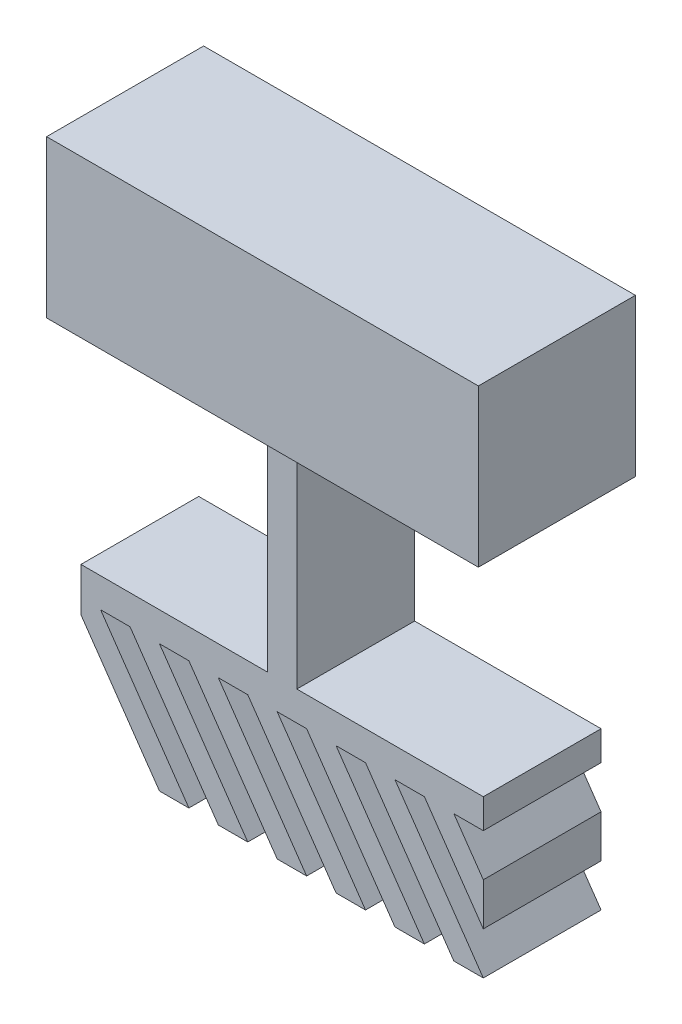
ISO-10303-21;
HEADER;
FILE_DESCRIPTION(('STEP AP214'),'2;1');
FILE_NAME('part.step','',(''),(''),'','','');
FILE_SCHEMA(('AUTOMOTIVE_DESIGN { 1 0 10303 214 1 1 1 1 }'));
ENDSEC;
DATA;
#1=APPLICATION_CONTEXT('core data for automotive mechanical design processes');
#2=APPLICATION_PROTOCOL_DEFINITION('international standard','automotive_design',2000,#1);
#3=PRODUCT_CONTEXT('',#1,'mechanical');
#4=PRODUCT('Part','Part','',(#3));
#5=PRODUCT_RELATED_PRODUCT_CATEGORY('part','',(#4));
#6=PRODUCT_DEFINITION_FORMATION('','',#4);
#7=PRODUCT_DEFINITION_CONTEXT('part definition',#1,'design');
#8=PRODUCT_DEFINITION('design','',#6,#7);
#9=PRODUCT_DEFINITION_SHAPE('','',#8);
#10=(LENGTH_UNIT() NAMED_UNIT(*) SI_UNIT(.MILLI.,.METRE.));
#11=(NAMED_UNIT(*) PLANE_ANGLE_UNIT() SI_UNIT($,.RADIAN.));
#12=(NAMED_UNIT(*) SI_UNIT($,.STERADIAN.) SOLID_ANGLE_UNIT());
#13=UNCERTAINTY_MEASURE_WITH_UNIT(LENGTH_MEASURE(1.E-05),#10,'distance_accuracy_value','');
#14=(GEOMETRIC_REPRESENTATION_CONTEXT(3) GLOBAL_UNCERTAINTY_ASSIGNED_CONTEXT((#13)) GLOBAL_UNIT_ASSIGNED_CONTEXT((#10,
#11,#12)) REPRESENTATION_CONTEXT('',''));
#15=CARTESIAN_POINT('',(0.,0.,0.));
#16=DIRECTION('',(0.,0.,1.));
#17=DIRECTION('',(1.,0.,0.));
#18=AXIS2_PLACEMENT_3D('',#15,#16,#17);
#19=CARTESIAN_POINT('',(-7.5,-150.,-30.));
#20=DIRECTION('',(-1.,0.,0.));
#21=DIRECTION('',(0.,-1.,0.));
#22=AXIS2_PLACEMENT_3D('',#19,#20,#21);
#23=PLANE('',#22);
#24=DIRECTION('',(0.,0.,1.));
#25=VECTOR('',#24,1.);
#26=CARTESIAN_POINT('',(-7.5,-150.,-30.));
#27=LINE('',#26,#25);
#28=CARTESIAN_POINT('',(-7.5,-150.,-30.));
#29=VERTEX_POINT('',#28);
#30=CARTESIAN_POINT('',(-7.5,-150.,30.));
#31=VERTEX_POINT('',#30);
#32=EDGE_CURVE('E44',#29,#31,#27,.T.);
#33=ORIENTED_EDGE('',*,*,#32,.T.);
#34=DIRECTION('',(0.,-1.,0.));
#35=VECTOR('',#34,1.);
#36=CARTESIAN_POINT('',(-7.5,-150.,30.));
#37=LINE('',#36,#35);
#38=CARTESIAN_POINT('',(-7.50000000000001,0.,30.));
#39=VERTEX_POINT('',#38);
#40=EDGE_CURVE('E267',#39,#31,#37,.T.);
#41=ORIENTED_EDGE('',*,*,#40,.F.);
#42=DIRECTION('',(0.,0.,1.));
#43=VECTOR('',#42,1.);
#44=CARTESIAN_POINT('',(-7.50000000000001,0.,-30.));
#45=LINE('',#44,#43);
#46=CARTESIAN_POINT('',(-7.50000000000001,0.,-30.));
#47=VERTEX_POINT('',#46);
#48=EDGE_CURVE('E12',#47,#39,#45,.T.);
#49=ORIENTED_EDGE('',*,*,#48,.F.);
#50=DIRECTION('',(0.,-1.,0.));
#51=VECTOR('',#50,1.);
#52=CARTESIAN_POINT('',(-7.5,-150.,-30.));
#53=LINE('',#52,#51);
#54=EDGE_CURVE('E268',#47,#29,#53,.T.);
#55=ORIENTED_EDGE('',*,*,#54,.T.);
#56=EDGE_LOOP('',(#33,#41,#49,#55));
#57=FACE_BOUND('',#56,.T.);
#58=ADVANCED_FACE('F41',(#57),#23,.T.);
#59=CARTESIAN_POINT('',(-7.50000000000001,0.,-30.));
#60=DIRECTION('',(0.,1.,0.));
#61=DIRECTION('',(0.,0.,1.));
#62=AXIS2_PLACEMENT_3D('',#59,#60,#61);
#63=PLANE('',#62);
#64=ORIENTED_EDGE('',*,*,#48,.T.);
#65=DIRECTION('',(-1.,0.,0.));
#66=VECTOR('',#65,1.);
#67=CARTESIAN_POINT('',(-7.50000000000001,0.,30.));
#68=LINE('',#67,#66);
#69=CARTESIAN_POINT('',(7.50000000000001,0.,30.));
#70=VERTEX_POINT('',#69);
#71=EDGE_CURVE('E285',#70,#39,#68,.T.);
#72=ORIENTED_EDGE('',*,*,#71,.F.);
#73=DIRECTION('',(0.,0.,1.));
#74=VECTOR('',#73,1.);
#75=CARTESIAN_POINT('',(7.50000000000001,0.,-30.));
#76=LINE('',#75,#74);
#77=CARTESIAN_POINT('',(7.50000000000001,0.,-30.));
#78=VERTEX_POINT('',#77);
#79=EDGE_CURVE('E49',#78,#70,#76,.T.);
#80=ORIENTED_EDGE('',*,*,#79,.F.);
#81=DIRECTION('',(-1.,0.,0.));
#82=VECTOR('',#81,1.);
#83=CARTESIAN_POINT('',(-7.50000000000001,0.,-30.));
#84=LINE('',#83,#82);
#85=EDGE_CURVE('E273',#78,#47,#84,.T.);
#86=ORIENTED_EDGE('',*,*,#85,.T.);
#87=EDGE_LOOP('',(#64,#72,#80,#86));
#88=FACE_BOUND('',#87,.T.);
#89=ADVANCED_FACE('F673',(#88),#63,.T.);
#90=CARTESIAN_POINT('',(7.50000000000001,0.,-30.));
#91=DIRECTION('',(1.,0.,0.));
#92=DIRECTION('',(0.,1.,0.));
#93=AXIS2_PLACEMENT_3D('',#90,#91,#92);
#94=PLANE('',#93);
#95=ORIENTED_EDGE('',*,*,#79,.T.);
#96=DIRECTION('',(0.,1.,0.));
#97=VECTOR('',#96,1.);
#98=CARTESIAN_POINT('',(7.50000000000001,0.,30.));
#99=LINE('',#98,#97);
#100=CARTESIAN_POINT('',(7.5,-150.,30.));
#101=VERTEX_POINT('',#100);
#102=EDGE_CURVE('E379',#101,#70,#99,.T.);
#103=ORIENTED_EDGE('',*,*,#102,.F.);
#104=DIRECTION('',(0.,0.,1.));
#105=VECTOR('',#104,1.);
#106=CARTESIAN_POINT('',(7.5,-150.,-30.));
#107=LINE('',#106,#105);
#108=CARTESIAN_POINT('',(7.5,-150.,-30.));
#109=VERTEX_POINT('',#108);
#110=EDGE_CURVE('E482',#109,#101,#107,.T.);
#111=ORIENTED_EDGE('',*,*,#110,.F.);
#112=DIRECTION('',(0.,1.,0.));
#113=VECTOR('',#112,1.);
#114=CARTESIAN_POINT('',(7.50000000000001,0.,-30.));
#115=LINE('',#114,#113);
#116=EDGE_CURVE('E478',#109,#78,#115,.T.);
#117=ORIENTED_EDGE('',*,*,#116,.T.);
#118=EDGE_LOOP('',(#95,#103,#111,#117));
#119=FACE_BOUND('',#118,.T.);
#120=ADVANCED_FACE('F672',(#119),#94,.T.);
#121=CARTESIAN_POINT('',(7.5,-150.,-30.));
#122=DIRECTION('',(0.,1.,0.));
#123=DIRECTION('',(-1.,0.,0.));
#124=AXIS2_PLACEMENT_3D('',#121,#122,#123);
#125=PLANE('',#124);
#126=ORIENTED_EDGE('',*,*,#110,.T.);
#127=DIRECTION('',(-1.,0.,0.));
#128=VECTOR('',#127,1.);
#129=CARTESIAN_POINT('',(7.5,-150.,30.));
#130=LINE('',#129,#128);
#131=CARTESIAN_POINT('',(102.5,-150.,30.));
#132=VERTEX_POINT('',#131);
#133=EDGE_CURVE('E376',#132,#101,#130,.T.);
#134=ORIENTED_EDGE('',*,*,#133,.F.);
#135=DIRECTION('',(0.,0.,1.));
#136=VECTOR('',#135,1.);
#137=CARTESIAN_POINT('',(102.5,-150.,-30.));
#138=LINE('',#137,#136);
#139=CARTESIAN_POINT('',(102.5,-150.,-30.));
#140=VERTEX_POINT('',#139);
#141=EDGE_CURVE('E484',#140,#132,#138,.T.);
#142=ORIENTED_EDGE('',*,*,#141,.F.);
#143=DIRECTION('',(-1.,0.,0.));
#144=VECTOR('',#143,1.);
#145=CARTESIAN_POINT('',(7.5,-150.,-30.));
#146=LINE('',#145,#144);
#147=EDGE_CURVE('E475',#140,#109,#146,.T.);
#148=ORIENTED_EDGE('',*,*,#147,.T.);
#149=EDGE_LOOP('',(#126,#134,#142,#148));
#150=FACE_BOUND('',#149,.T.);
#151=ADVANCED_FACE('F668',(#150),#125,.T.);
#152=CARTESIAN_POINT('',(102.5,-150.,-30.));
#153=DIRECTION('',(1.,0.,0.));
#154=DIRECTION('',(0.,1.,0.));
#155=AXIS2_PLACEMENT_3D('',#152,#153,#154);
#156=PLANE('',#155);
#157=ORIENTED_EDGE('',*,*,#141,.T.);
#158=DIRECTION('',(0.,1.,0.));
#159=VECTOR('',#158,1.);
#160=CARTESIAN_POINT('',(102.5,-150.,30.));
#161=LINE('',#160,#159);
#162=CARTESIAN_POINT('',(102.5,-165.,30.));
#163=VERTEX_POINT('',#162);
#164=EDGE_CURVE('E373',#163,#132,#161,.T.);
#165=ORIENTED_EDGE('',*,*,#164,.F.);
#166=DIRECTION('',(0.,0.,1.));
#167=VECTOR('',#166,1.);
#168=CARTESIAN_POINT('',(102.5,-165.,-30.));
#169=LINE('',#168,#167);
#170=CARTESIAN_POINT('',(102.5,-165.,-30.));
#171=VERTEX_POINT('',#170);
#172=EDGE_CURVE('E486',#171,#163,#169,.T.);
#173=ORIENTED_EDGE('',*,*,#172,.F.);
#174=DIRECTION('',(0.,1.,0.));
#175=VECTOR('',#174,1.);
#176=CARTESIAN_POINT('',(102.5,-150.,-30.));
#177=LINE('',#176,#175);
#178=EDGE_CURVE('E472',#171,#140,#177,.T.);
#179=ORIENTED_EDGE('',*,*,#178,.T.);
#180=EDGE_LOOP('',(#157,#165,#173,#179));
#181=FACE_BOUND('',#180,.T.);
#182=ADVANCED_FACE('F663',(#181),#156,.T.);
#183=CARTESIAN_POINT('',(102.5,-165.,-30.));
#184=DIRECTION('',(0.,-1.,0.));
#185=DIRECTION('',(0.,0.,-1.));
#186=AXIS2_PLACEMENT_3D('',#183,#184,#185);
#187=PLANE('',#186);
#188=ORIENTED_EDGE('',*,*,#172,.T.);
#189=DIRECTION('',(1.,0.,0.));
#190=VECTOR('',#189,1.);
#191=CARTESIAN_POINT('',(102.5,-165.,30.));
#192=LINE('',#191,#190);
#193=CARTESIAN_POINT('',(87.5,-165.,30.));
#194=VERTEX_POINT('',#193);
#195=EDGE_CURVE('E370',#194,#163,#192,.T.);
#196=ORIENTED_EDGE('',*,*,#195,.F.);
#197=DIRECTION('',(0.,0.,1.));
#198=VECTOR('',#197,1.);
#199=CARTESIAN_POINT('',(87.5,-165.,-30.));
#200=LINE('',#199,#198);
#201=CARTESIAN_POINT('',(87.5,-165.,-30.));
#202=VERTEX_POINT('',#201);
#203=EDGE_CURVE('E488',#202,#194,#200,.T.);
#204=ORIENTED_EDGE('',*,*,#203,.F.);
#205=DIRECTION('',(1.,0.,0.));
#206=VECTOR('',#205,1.);
#207=CARTESIAN_POINT('',(102.5,-165.,-30.));
#208=LINE('',#207,#206);
#209=EDGE_CURVE('E469',#202,#171,#208,.T.);
#210=ORIENTED_EDGE('',*,*,#209,.T.);
#211=EDGE_LOOP('',(#188,#196,#204,#210));
#212=FACE_BOUND('',#211,.T.);
#213=ADVANCED_FACE('F661',(#212),#187,.T.);
#214=CARTESIAN_POINT('',(87.5,-165.,-30.));
#215=DIRECTION('',(0.822192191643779,0.569209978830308,0.));
#216=DIRECTION('',(-0.569209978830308,0.822192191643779,0.));
#217=AXIS2_PLACEMENT_3D('',#214,#215,#216);
#218=PLANE('',#217);
#219=ORIENTED_EDGE('',*,*,#203,.T.);
#220=DIRECTION('',(-0.569209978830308,0.822192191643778,0.));
#221=VECTOR('',#220,1.);
#222=CARTESIAN_POINT('',(87.5,-165.,30.));
#223=LINE('',#222,#221);
#224=CARTESIAN_POINT('',(102.5,-186.666666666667,30.));
#225=VERTEX_POINT('',#224);
#226=EDGE_CURVE('E367',#225,#194,#223,.T.);
#227=ORIENTED_EDGE('',*,*,#226,.F.);
#228=DIRECTION('',(0.,0.,1.));
#229=VECTOR('',#228,1.);
#230=CARTESIAN_POINT('',(102.5,-186.666666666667,-30.));
#231=LINE('',#230,#229);
#232=CARTESIAN_POINT('',(102.5,-186.666666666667,-30.));
#233=VERTEX_POINT('',#232);
#234=EDGE_CURVE('E490',#233,#225,#231,.T.);
#235=ORIENTED_EDGE('',*,*,#234,.F.);
#236=DIRECTION('',(-0.569209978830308,0.822192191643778,0.));
#237=VECTOR('',#236,1.);
#238=CARTESIAN_POINT('',(87.5,-165.,-30.));
#239=LINE('',#238,#237);
#240=EDGE_CURVE('E466',#233,#202,#239,.T.);
#241=ORIENTED_EDGE('',*,*,#240,.T.);
#242=EDGE_LOOP('',(#219,#227,#235,#241));
#243=FACE_BOUND('',#242,.T.);
#244=ADVANCED_FACE('F656',(#243),#218,.T.);
#245=CARTESIAN_POINT('',(102.5,-186.666666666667,-30.));
#246=DIRECTION('',(1.,0.,0.));
#247=DIRECTION('',(0.,0.,-1.));
#248=AXIS2_PLACEMENT_3D('',#245,#246,#247);
#249=PLANE('',#248);
#250=ORIENTED_EDGE('',*,*,#234,.T.);
#251=DIRECTION('',(0.,1.,0.));
#252=VECTOR('',#251,1.);
#253=CARTESIAN_POINT('',(102.5,-186.666666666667,30.));
#254=LINE('',#253,#252);
#255=CARTESIAN_POINT('',(102.5,-208.333333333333,30.));
#256=VERTEX_POINT('',#255);
#257=EDGE_CURVE('E364',#256,#225,#254,.T.);
#258=ORIENTED_EDGE('',*,*,#257,.F.);
#259=DIRECTION('',(0.,0.,1.));
#260=VECTOR('',#259,1.);
#261=CARTESIAN_POINT('',(102.5,-208.333333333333,-30.));
#262=LINE('',#261,#260);
#263=CARTESIAN_POINT('',(102.5,-208.333333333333,-30.));
#264=VERTEX_POINT('',#263);
#265=EDGE_CURVE('E492',#264,#256,#262,.T.);
#266=ORIENTED_EDGE('',*,*,#265,.F.);
#267=DIRECTION('',(0.,1.,0.));
#268=VECTOR('',#267,1.);
#269=CARTESIAN_POINT('',(102.5,-186.666666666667,-30.));
#270=LINE('',#269,#268);
#271=EDGE_CURVE('E463',#264,#233,#270,.T.);
#272=ORIENTED_EDGE('',*,*,#271,.T.);
#273=EDGE_LOOP('',(#250,#258,#266,#272));
#274=FACE_BOUND('',#273,.T.);
#275=ADVANCED_FACE('F651',(#274),#249,.T.);
#276=CARTESIAN_POINT('',(102.5,-208.333333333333,-30.));
#277=DIRECTION('',(-0.822192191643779,-0.569209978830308,0.));
#278=DIRECTION('',(0.569209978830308,-0.822192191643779,0.));
#279=AXIS2_PLACEMENT_3D('',#276,#277,#278);
#280=PLANE('',#279);
#281=ORIENTED_EDGE('',*,*,#265,.T.);
#282=DIRECTION('',(0.569209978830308,-0.822192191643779,0.));
#283=VECTOR('',#282,1.);
#284=CARTESIAN_POINT('',(102.5,-208.333333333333,30.));
#285=LINE('',#284,#283);
#286=CARTESIAN_POINT('',(72.5,-165.,30.));
#287=VERTEX_POINT('',#286);
#288=EDGE_CURVE('E361',#287,#256,#285,.T.);
#289=ORIENTED_EDGE('',*,*,#288,.F.);
#290=DIRECTION('',(0.,0.,1.));
#291=VECTOR('',#290,1.);
#292=CARTESIAN_POINT('',(72.5,-165.,-30.));
#293=LINE('',#292,#291);
#294=CARTESIAN_POINT('',(72.5,-165.,-30.));
#295=VERTEX_POINT('',#294);
#296=EDGE_CURVE('E494',#295,#287,#293,.T.);
#297=ORIENTED_EDGE('',*,*,#296,.F.);
#298=DIRECTION('',(0.569209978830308,-0.822192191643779,0.));
#299=VECTOR('',#298,1.);
#300=CARTESIAN_POINT('',(102.5,-208.333333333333,-30.));
#301=LINE('',#300,#299);
#302=EDGE_CURVE('E460',#295,#264,#301,.T.);
#303=ORIENTED_EDGE('',*,*,#302,.T.);
#304=EDGE_LOOP('',(#281,#289,#297,#303));
#305=FACE_BOUND('',#304,.T.);
#306=ADVANCED_FACE('F649',(#305),#280,.T.);
#307=CARTESIAN_POINT('',(72.5,-165.,-30.));
#308=DIRECTION('',(0.,-1.,0.));
#309=DIRECTION('',(1.,0.,0.));
#310=AXIS2_PLACEMENT_3D('',#307,#308,#309);
#311=PLANE('',#310);
#312=ORIENTED_EDGE('',*,*,#296,.T.);
#313=DIRECTION('',(1.,0.,0.));
#314=VECTOR('',#313,1.);
#315=CARTESIAN_POINT('',(72.5,-165.,30.));
#316=LINE('',#315,#314);
#317=CARTESIAN_POINT('',(57.5,-165.,30.));
#318=VERTEX_POINT('',#317);
#319=EDGE_CURVE('E358',#318,#287,#316,.T.);
#320=ORIENTED_EDGE('',*,*,#319,.F.);
#321=DIRECTION('',(0.,0.,1.));
#322=VECTOR('',#321,1.);
#323=CARTESIAN_POINT('',(57.5,-165.,-30.));
#324=LINE('',#323,#322);
#325=CARTESIAN_POINT('',(57.5,-165.,-30.));
#326=VERTEX_POINT('',#325);
#327=EDGE_CURVE('E496',#326,#318,#324,.T.);
#328=ORIENTED_EDGE('',*,*,#327,.F.);
#329=DIRECTION('',(1.,0.,0.));
#330=VECTOR('',#329,1.);
#331=CARTESIAN_POINT('',(72.5,-165.,-30.));
#332=LINE('',#331,#330);
#333=EDGE_CURVE('E457',#326,#295,#332,.T.);
#334=ORIENTED_EDGE('',*,*,#333,.T.);
#335=EDGE_LOOP('',(#312,#320,#328,#334));
#336=FACE_BOUND('',#335,.T.);
#337=ADVANCED_FACE('F644',(#336),#311,.T.);
#338=CARTESIAN_POINT('',(57.5,-165.,-30.));
#339=DIRECTION('',(0.822192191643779,0.569209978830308,0.));
#340=DIRECTION('',(-0.569209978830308,0.822192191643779,0.));
#341=AXIS2_PLACEMENT_3D('',#338,#339,#340);
#342=PLANE('',#341);
#343=ORIENTED_EDGE('',*,*,#327,.T.);
#344=DIRECTION('',(-0.569209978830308,0.822192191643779,0.));
#345=VECTOR('',#344,1.);
#346=CARTESIAN_POINT('',(57.5,-165.,30.));
#347=LINE('',#346,#345);
#348=CARTESIAN_POINT('',(102.5,-230.,30.));
#349=VERTEX_POINT('',#348);
#350=EDGE_CURVE('E355',#349,#318,#347,.T.);
#351=ORIENTED_EDGE('',*,*,#350,.F.);
#352=DIRECTION('',(0.,0.,1.));
#353=VECTOR('',#352,1.);
#354=CARTESIAN_POINT('',(102.5,-230.,-30.));
#355=LINE('',#354,#353);
#356=CARTESIAN_POINT('',(102.5,-230.,-30.));
#357=VERTEX_POINT('',#356);
#358=EDGE_CURVE('E498',#357,#349,#355,.T.);
#359=ORIENTED_EDGE('',*,*,#358,.F.);
#360=DIRECTION('',(-0.569209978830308,0.822192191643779,0.));
#361=VECTOR('',#360,1.);
#362=CARTESIAN_POINT('',(57.5,-165.,-30.));
#363=LINE('',#362,#361);
#364=EDGE_CURVE('E454',#357,#326,#363,.T.);
#365=ORIENTED_EDGE('',*,*,#364,.T.);
#366=EDGE_LOOP('',(#343,#351,#359,#365));
#367=FACE_BOUND('',#366,.T.);
#368=ADVANCED_FACE('F639',(#367),#342,.T.);
#369=CARTESIAN_POINT('',(102.5,-230.,-30.));
#370=DIRECTION('',(0.,-1.,0.));
#371=DIRECTION('',(1.,0.,0.));
#372=AXIS2_PLACEMENT_3D('',#369,#370,#371);
#373=PLANE('',#372);
#374=ORIENTED_EDGE('',*,*,#358,.T.);
#375=DIRECTION('',(1.,0.,0.));
#376=VECTOR('',#375,1.);
#377=CARTESIAN_POINT('',(102.5,-230.,30.));
#378=LINE('',#377,#376);
#379=CARTESIAN_POINT('',(87.5,-230.,30.));
#380=VERTEX_POINT('',#379);
#381=EDGE_CURVE('E352',#380,#349,#378,.T.);
#382=ORIENTED_EDGE('',*,*,#381,.F.);
#383=DIRECTION('',(0.,0.,1.));
#384=VECTOR('',#383,1.);
#385=CARTESIAN_POINT('',(87.5,-230.,-30.));
#386=LINE('',#385,#384);
#387=CARTESIAN_POINT('',(87.5,-230.,-30.));
#388=VERTEX_POINT('',#387);
#389=EDGE_CURVE('E500',#388,#380,#386,.T.);
#390=ORIENTED_EDGE('',*,*,#389,.F.);
#391=DIRECTION('',(1.,0.,0.));
#392=VECTOR('',#391,1.);
#393=CARTESIAN_POINT('',(102.5,-230.,-30.));
#394=LINE('',#393,#392);
#395=EDGE_CURVE('E451',#388,#357,#394,.T.);
#396=ORIENTED_EDGE('',*,*,#395,.T.);
#397=EDGE_LOOP('',(#374,#382,#390,#396));
#398=FACE_BOUND('',#397,.T.);
#399=ADVANCED_FACE('F637',(#398),#373,.T.);
#400=CARTESIAN_POINT('',(87.5,-230.,-30.));
#401=DIRECTION('',(-0.822192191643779,-0.569209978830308,0.));
#402=DIRECTION('',(0.569209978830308,-0.822192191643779,0.));
#403=AXIS2_PLACEMENT_3D('',#400,#401,#402);
#404=PLANE('',#403);
#405=ORIENTED_EDGE('',*,*,#389,.T.);
#406=DIRECTION('',(0.569209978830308,-0.822192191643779,0.));
#407=VECTOR('',#406,1.);
#408=CARTESIAN_POINT('',(87.5,-230.,30.));
#409=LINE('',#408,#407);
#410=CARTESIAN_POINT('',(42.5,-165.,30.));
#411=VERTEX_POINT('',#410);
#412=EDGE_CURVE('E349',#411,#380,#409,.T.);
#413=ORIENTED_EDGE('',*,*,#412,.F.);
#414=DIRECTION('',(0.,0.,1.));
#415=VECTOR('',#414,1.);
#416=CARTESIAN_POINT('',(42.5,-165.,-30.));
#417=LINE('',#416,#415);
#418=CARTESIAN_POINT('',(42.5,-165.,-30.));
#419=VERTEX_POINT('',#418);
#420=EDGE_CURVE('E502',#419,#411,#417,.T.);
#421=ORIENTED_EDGE('',*,*,#420,.F.);
#422=DIRECTION('',(0.569209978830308,-0.822192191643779,0.));
#423=VECTOR('',#422,1.);
#424=CARTESIAN_POINT('',(87.5,-230.,-30.));
#425=LINE('',#424,#423);
#426=EDGE_CURVE('E448',#419,#388,#425,.T.);
#427=ORIENTED_EDGE('',*,*,#426,.T.);
#428=EDGE_LOOP('',(#405,#413,#421,#427));
#429=FACE_BOUND('',#428,.T.);
#430=ADVANCED_FACE('F632',(#429),#404,.T.);
#431=CARTESIAN_POINT('',(42.5,-165.,-30.));
#432=DIRECTION('',(0.,-1.,0.));
#433=DIRECTION('',(0.,0.,-1.));
#434=AXIS2_PLACEMENT_3D('',#431,#432,#433);
#435=PLANE('',#434);
#436=ORIENTED_EDGE('',*,*,#420,.T.);
#437=DIRECTION('',(1.,0.,0.));
#438=VECTOR('',#437,1.);
#439=CARTESIAN_POINT('',(42.5,-165.,30.));
#440=LINE('',#439,#438);
#441=CARTESIAN_POINT('',(27.5,-165.,30.));
#442=VERTEX_POINT('',#441);
#443=EDGE_CURVE('E346',#442,#411,#440,.T.);
#444=ORIENTED_EDGE('',*,*,#443,.F.);
#445=DIRECTION('',(0.,0.,1.));
#446=VECTOR('',#445,1.);
#447=CARTESIAN_POINT('',(27.5,-165.,-30.));
#448=LINE('',#447,#446);
#449=CARTESIAN_POINT('',(27.5,-165.,-30.));
#450=VERTEX_POINT('',#449);
#451=EDGE_CURVE('E504',#450,#442,#448,.T.);
#452=ORIENTED_EDGE('',*,*,#451,.F.);
#453=DIRECTION('',(1.,0.,0.));
#454=VECTOR('',#453,1.);
#455=CARTESIAN_POINT('',(42.5,-165.,-30.));
#456=LINE('',#455,#454);
#457=EDGE_CURVE('E445',#450,#419,#456,.T.);
#458=ORIENTED_EDGE('',*,*,#457,.T.);
#459=EDGE_LOOP('',(#436,#444,#452,#458));
#460=FACE_BOUND('',#459,.T.);
#461=ADVANCED_FACE('F627',(#460),#435,.T.);
#462=CARTESIAN_POINT('',(27.5,-165.,-30.));
#463=DIRECTION('',(0.822192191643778,0.569209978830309,0.));
#464=DIRECTION('',(-0.569209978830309,0.822192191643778,0.));
#465=AXIS2_PLACEMENT_3D('',#462,#463,#464);
#466=PLANE('',#465);
#467=ORIENTED_EDGE('',*,*,#451,.T.);
#468=DIRECTION('',(-0.569209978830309,0.822192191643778,0.));
#469=VECTOR('',#468,1.);
#470=CARTESIAN_POINT('',(27.5,-165.,30.));
#471=LINE('',#470,#469);
#472=CARTESIAN_POINT('',(72.5000000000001,-230.,30.));
#473=VERTEX_POINT('',#472);
#474=EDGE_CURVE('E343',#473,#442,#471,.T.);
#475=ORIENTED_EDGE('',*,*,#474,.F.);
#476=DIRECTION('',(0.,0.,1.));
#477=VECTOR('',#476,1.);
#478=CARTESIAN_POINT('',(72.5000000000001,-230.,-30.));
#479=LINE('',#478,#477);
#480=CARTESIAN_POINT('',(72.5000000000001,-230.,-30.));
#481=VERTEX_POINT('',#480);
#482=EDGE_CURVE('E506',#481,#473,#479,.T.);
#483=ORIENTED_EDGE('',*,*,#482,.F.);
#484=DIRECTION('',(-0.569209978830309,0.822192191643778,0.));
#485=VECTOR('',#484,1.);
#486=CARTESIAN_POINT('',(27.5,-165.,-30.));
#487=LINE('',#486,#485);
#488=EDGE_CURVE('E442',#481,#450,#487,.T.);
#489=ORIENTED_EDGE('',*,*,#488,.T.);
#490=EDGE_LOOP('',(#467,#475,#483,#489));
#491=FACE_BOUND('',#490,.T.);
#492=ADVANCED_FACE('F625',(#491),#466,.T.);
#493=CARTESIAN_POINT('',(72.5000000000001,-230.,-30.));
#494=DIRECTION('',(0.,-1.,0.));
#495=DIRECTION('',(1.,0.,0.));
#496=AXIS2_PLACEMENT_3D('',#493,#494,#495);
#497=PLANE('',#496);
#498=ORIENTED_EDGE('',*,*,#482,.T.);
#499=DIRECTION('',(1.,0.,0.));
#500=VECTOR('',#499,1.);
#501=CARTESIAN_POINT('',(72.5000000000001,-230.,30.));
#502=LINE('',#501,#500);
#503=CARTESIAN_POINT('',(57.5000000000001,-230.,30.));
#504=VERTEX_POINT('',#503);
#505=EDGE_CURVE('E340',#504,#473,#502,.T.);
#506=ORIENTED_EDGE('',*,*,#505,.F.);
#507=DIRECTION('',(0.,0.,1.));
#508=VECTOR('',#507,1.);
#509=CARTESIAN_POINT('',(57.5000000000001,-230.,-30.));
#510=LINE('',#509,#508);
#511=CARTESIAN_POINT('',(57.5000000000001,-230.,-30.));
#512=VERTEX_POINT('',#511);
#513=EDGE_CURVE('E508',#512,#504,#510,.T.);
#514=ORIENTED_EDGE('',*,*,#513,.F.);
#515=DIRECTION('',(1.,0.,0.));
#516=VECTOR('',#515,1.);
#517=CARTESIAN_POINT('',(72.5000000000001,-230.,-30.));
#518=LINE('',#517,#516);
#519=EDGE_CURVE('E439',#512,#481,#518,.T.);
#520=ORIENTED_EDGE('',*,*,#519,.T.);
#521=EDGE_LOOP('',(#498,#506,#514,#520));
#522=FACE_BOUND('',#521,.T.);
#523=ADVANCED_FACE('F620',(#522),#497,.T.);
#524=CARTESIAN_POINT('',(57.5000000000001,-230.,-30.));
#525=DIRECTION('',(-0.822192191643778,-0.569209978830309,0.));
#526=DIRECTION('',(0.569209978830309,-0.822192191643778,0.));
#527=AXIS2_PLACEMENT_3D('',#524,#525,#526);
#528=PLANE('',#527);
#529=ORIENTED_EDGE('',*,*,#513,.T.);
#530=DIRECTION('',(0.569209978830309,-0.822192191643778,0.));
#531=VECTOR('',#530,1.);
#532=CARTESIAN_POINT('',(57.5000000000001,-230.,30.));
#533=LINE('',#532,#531);
#534=CARTESIAN_POINT('',(12.5000000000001,-165.,30.));
#535=VERTEX_POINT('',#534);
#536=EDGE_CURVE('E337',#535,#504,#533,.T.);
#537=ORIENTED_EDGE('',*,*,#536,.F.);
#538=DIRECTION('',(0.,0.,1.));
#539=VECTOR('',#538,1.);
#540=CARTESIAN_POINT('',(12.5000000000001,-165.,-30.));
#541=LINE('',#540,#539);
#542=CARTESIAN_POINT('',(12.5000000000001,-165.,-30.));
#543=VERTEX_POINT('',#542);
#544=EDGE_CURVE('E510',#543,#535,#541,.T.);
#545=ORIENTED_EDGE('',*,*,#544,.F.);
#546=DIRECTION('',(0.569209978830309,-0.822192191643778,0.));
#547=VECTOR('',#546,1.);
#548=CARTESIAN_POINT('',(57.5000000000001,-230.,-30.));
#549=LINE('',#548,#547);
#550=EDGE_CURVE('E436',#543,#512,#549,.T.);
#551=ORIENTED_EDGE('',*,*,#550,.T.);
#552=EDGE_LOOP('',(#529,#537,#545,#551));
#553=FACE_BOUND('',#552,.T.);
#554=ADVANCED_FACE('F615',(#553),#528,.T.);
#555=CARTESIAN_POINT('',(12.5000000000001,-165.,-30.));
#556=DIRECTION('',(0.,-1.,0.));
#557=DIRECTION('',(0.,0.,-1.));
#558=AXIS2_PLACEMENT_3D('',#555,#556,#557);
#559=PLANE('',#558);
#560=ORIENTED_EDGE('',*,*,#544,.T.);
#561=DIRECTION('',(1.,0.,0.));
#562=VECTOR('',#561,1.);
#563=CARTESIAN_POINT('',(12.5000000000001,-165.,30.));
#564=LINE('',#563,#562);
#565=CARTESIAN_POINT('',(-2.49999999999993,-165.,30.));
#566=VERTEX_POINT('',#565);
#567=EDGE_CURVE('E334',#566,#535,#564,.T.);
#568=ORIENTED_EDGE('',*,*,#567,.F.);
#569=DIRECTION('',(0.,0.,1.));
#570=VECTOR('',#569,1.);
#571=CARTESIAN_POINT('',(-2.49999999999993,-165.,-30.));
#572=LINE('',#571,#570);
#573=CARTESIAN_POINT('',(-2.49999999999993,-165.,-30.));
#574=VERTEX_POINT('',#573);
#575=EDGE_CURVE('E512',#574,#566,#572,.T.);
#576=ORIENTED_EDGE('',*,*,#575,.F.);
#577=DIRECTION('',(1.,0.,0.));
#578=VECTOR('',#577,1.);
#579=CARTESIAN_POINT('',(12.5000000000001,-165.,-30.));
#580=LINE('',#579,#578);
#581=EDGE_CURVE('E433',#574,#543,#580,.T.);
#582=ORIENTED_EDGE('',*,*,#581,.T.);
#583=EDGE_LOOP('',(#560,#568,#576,#582));
#584=FACE_BOUND('',#583,.T.);
#585=ADVANCED_FACE('F613',(#584),#559,.T.);
#586=CARTESIAN_POINT('',(-2.49999999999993,-165.,-30.));
#587=DIRECTION('',(0.822192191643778,0.569209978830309,0.));
#588=DIRECTION('',(-0.569209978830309,0.822192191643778,0.));
#589=AXIS2_PLACEMENT_3D('',#586,#587,#588);
#590=PLANE('',#589);
#591=ORIENTED_EDGE('',*,*,#575,.T.);
#592=DIRECTION('',(-0.569209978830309,0.822192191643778,0.));
#593=VECTOR('',#592,1.);
#594=CARTESIAN_POINT('',(-2.49999999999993,-165.,30.));
#595=LINE('',#594,#593);
#596=CARTESIAN_POINT('',(42.5000000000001,-230.,30.));
#597=VERTEX_POINT('',#596);
#598=EDGE_CURVE('E331',#597,#566,#595,.T.);
#599=ORIENTED_EDGE('',*,*,#598,.F.);
#600=DIRECTION('',(0.,0.,1.));
#601=VECTOR('',#600,1.);
#602=CARTESIAN_POINT('',(42.5000000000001,-230.,-30.));
#603=LINE('',#602,#601);
#604=CARTESIAN_POINT('',(42.5000000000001,-230.,-30.));
#605=VERTEX_POINT('',#604);
#606=EDGE_CURVE('E514',#605,#597,#603,.T.);
#607=ORIENTED_EDGE('',*,*,#606,.F.);
#608=DIRECTION('',(-0.569209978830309,0.822192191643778,0.));
#609=VECTOR('',#608,1.);
#610=CARTESIAN_POINT('',(-2.49999999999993,-165.,-30.));
#611=LINE('',#610,#609);
#612=EDGE_CURVE('E430',#605,#574,#611,.T.);
#613=ORIENTED_EDGE('',*,*,#612,.T.);
#614=EDGE_LOOP('',(#591,#599,#607,#613));
#615=FACE_BOUND('',#614,.T.);
#616=ADVANCED_FACE('F608',(#615),#590,.T.);
#617=CARTESIAN_POINT('',(42.5000000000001,-230.,-30.));
#618=DIRECTION('',(0.,-1.,0.));
#619=DIRECTION('',(0.,0.,-1.));
#620=AXIS2_PLACEMENT_3D('',#617,#618,#619);
#621=PLANE('',#620);
#622=ORIENTED_EDGE('',*,*,#606,.T.);
#623=DIRECTION('',(1.,0.,0.));
#624=VECTOR('',#623,1.);
#625=CARTESIAN_POINT('',(42.5000000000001,-230.,30.));
#626=LINE('',#625,#624);
#627=CARTESIAN_POINT('',(27.5000000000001,-230.,30.));
#628=VERTEX_POINT('',#627);
#629=EDGE_CURVE('E328',#628,#597,#626,.T.);
#630=ORIENTED_EDGE('',*,*,#629,.F.);
#631=DIRECTION('',(0.,0.,1.));
#632=VECTOR('',#631,1.);
#633=CARTESIAN_POINT('',(27.5000000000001,-230.,-30.));
#634=LINE('',#633,#632);
#635=CARTESIAN_POINT('',(27.5000000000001,-230.,-30.));
#636=VERTEX_POINT('',#635);
#637=EDGE_CURVE('E516',#636,#628,#634,.T.);
#638=ORIENTED_EDGE('',*,*,#637,.F.);
#639=DIRECTION('',(1.,0.,0.));
#640=VECTOR('',#639,1.);
#641=CARTESIAN_POINT('',(42.5000000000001,-230.,-30.));
#642=LINE('',#641,#640);
#643=EDGE_CURVE('E427',#636,#605,#642,.T.);
#644=ORIENTED_EDGE('',*,*,#643,.T.);
#645=EDGE_LOOP('',(#622,#630,#638,#644));
#646=FACE_BOUND('',#645,.T.);
#647=ADVANCED_FACE('F603',(#646),#621,.T.);
#648=CARTESIAN_POINT('',(27.5000000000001,-230.,-30.));
#649=DIRECTION('',(-0.822192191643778,-0.569209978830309,0.));
#650=DIRECTION('',(0.569209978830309,-0.822192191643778,0.));
#651=AXIS2_PLACEMENT_3D('',#648,#649,#650);
#652=PLANE('',#651);
#653=ORIENTED_EDGE('',*,*,#637,.T.);
#654=DIRECTION('',(0.569209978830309,-0.822192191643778,0.));
#655=VECTOR('',#654,1.);
#656=CARTESIAN_POINT('',(27.5000000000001,-230.,30.));
#657=LINE('',#656,#655);
#658=CARTESIAN_POINT('',(-17.5,-165.,30.));
#659=VERTEX_POINT('',#658);
#660=EDGE_CURVE('E325',#659,#628,#657,.T.);
#661=ORIENTED_EDGE('',*,*,#660,.F.);
#662=DIRECTION('',(0.,0.,1.));
#663=VECTOR('',#662,1.);
#664=CARTESIAN_POINT('',(-17.5,-165.,-30.));
#665=LINE('',#664,#663);
#666=CARTESIAN_POINT('',(-17.5,-165.,-30.));
#667=VERTEX_POINT('',#666);
#668=EDGE_CURVE('E518',#667,#659,#665,.T.);
#669=ORIENTED_EDGE('',*,*,#668,.F.);
#670=DIRECTION('',(0.569209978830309,-0.822192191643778,0.));
#671=VECTOR('',#670,1.);
#672=CARTESIAN_POINT('',(27.5000000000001,-230.,-30.));
#673=LINE('',#672,#671);
#674=EDGE_CURVE('E424',#667,#636,#673,.T.);
#675=ORIENTED_EDGE('',*,*,#674,.T.);
#676=EDGE_LOOP('',(#653,#661,#669,#675));
#677=FACE_BOUND('',#676,.T.);
#678=ADVANCED_FACE('F601',(#677),#652,.T.);
#679=CARTESIAN_POINT('',(-17.5,-165.,-30.));
#680=DIRECTION('',(0.,-1.,0.));
#681=DIRECTION('',(0.,0.,-1.));
#682=AXIS2_PLACEMENT_3D('',#679,#680,#681);
#683=PLANE('',#682);
#684=ORIENTED_EDGE('',*,*,#668,.T.);
#685=DIRECTION('',(1.,0.,0.));
#686=VECTOR('',#685,1.);
#687=CARTESIAN_POINT('',(-17.5,-165.,30.));
#688=LINE('',#687,#686);
#689=CARTESIAN_POINT('',(-32.5,-165.,30.));
#690=VERTEX_POINT('',#689);
#691=EDGE_CURVE('E322',#690,#659,#688,.T.);
#692=ORIENTED_EDGE('',*,*,#691,.F.);
#693=DIRECTION('',(0.,0.,1.));
#694=VECTOR('',#693,1.);
#695=CARTESIAN_POINT('',(-32.5,-165.,-30.));
#696=LINE('',#695,#694);
#697=CARTESIAN_POINT('',(-32.5,-165.,-30.));
#698=VERTEX_POINT('',#697);
#699=EDGE_CURVE('E520',#698,#690,#696,.T.);
#700=ORIENTED_EDGE('',*,*,#699,.F.);
#701=DIRECTION('',(1.,0.,0.));
#702=VECTOR('',#701,1.);
#703=CARTESIAN_POINT('',(-17.5,-165.,-30.));
#704=LINE('',#703,#702);
#705=EDGE_CURVE('E421',#698,#667,#704,.T.);
#706=ORIENTED_EDGE('',*,*,#705,.T.);
#707=EDGE_LOOP('',(#684,#692,#700,#706));
#708=FACE_BOUND('',#707,.T.);
#709=ADVANCED_FACE('F596',(#708),#683,.T.);
#710=CARTESIAN_POINT('',(-32.5,-165.,-30.));
#711=DIRECTION('',(0.822192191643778,0.569209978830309,0.));
#712=DIRECTION('',(-0.569209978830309,0.822192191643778,0.));
#713=AXIS2_PLACEMENT_3D('',#710,#711,#712);
#714=PLANE('',#713);
#715=ORIENTED_EDGE('',*,*,#699,.T.);
#716=DIRECTION('',(-0.569209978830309,0.822192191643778,0.));
#717=VECTOR('',#716,1.);
#718=CARTESIAN_POINT('',(-32.5,-165.,30.));
#719=LINE('',#718,#717);
#720=CARTESIAN_POINT('',(12.5000000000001,-230.,30.));
#721=VERTEX_POINT('',#720);
#722=EDGE_CURVE('E319',#721,#690,#719,.T.);
#723=ORIENTED_EDGE('',*,*,#722,.F.);
#724=DIRECTION('',(0.,0.,1.));
#725=VECTOR('',#724,1.);
#726=CARTESIAN_POINT('',(12.5000000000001,-230.,-30.));
#727=LINE('',#726,#725);
#728=CARTESIAN_POINT('',(12.5000000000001,-230.,-30.));
#729=VERTEX_POINT('',#728);
#730=EDGE_CURVE('E522',#729,#721,#727,.T.);
#731=ORIENTED_EDGE('',*,*,#730,.F.);
#732=DIRECTION('',(-0.569209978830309,0.822192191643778,0.));
#733=VECTOR('',#732,1.);
#734=CARTESIAN_POINT('',(-32.5,-165.,-30.));
#735=LINE('',#734,#733);
#736=EDGE_CURVE('E418',#729,#698,#735,.T.);
#737=ORIENTED_EDGE('',*,*,#736,.T.);
#738=EDGE_LOOP('',(#715,#723,#731,#737));
#739=FACE_BOUND('',#738,.T.);
#740=ADVANCED_FACE('F591',(#739),#714,.T.);
#741=CARTESIAN_POINT('',(12.5000000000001,-230.,-30.));
#742=DIRECTION('',(0.,-1.,0.));
#743=DIRECTION('',(0.,0.,-1.));
#744=AXIS2_PLACEMENT_3D('',#741,#742,#743);
#745=PLANE('',#744);
#746=ORIENTED_EDGE('',*,*,#730,.T.);
#747=DIRECTION('',(1.,0.,0.));
#748=VECTOR('',#747,1.);
#749=CARTESIAN_POINT('',(12.5000000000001,-230.,30.));
#750=LINE('',#749,#748);
#751=CARTESIAN_POINT('',(-2.4999999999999,-230.,30.));
#752=VERTEX_POINT('',#751);
#753=EDGE_CURVE('E316',#752,#721,#750,.T.);
#754=ORIENTED_EDGE('',*,*,#753,.F.);
#755=DIRECTION('',(0.,0.,1.));
#756=VECTOR('',#755,1.);
#757=CARTESIAN_POINT('',(-2.4999999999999,-230.,-30.));
#758=LINE('',#757,#756);
#759=CARTESIAN_POINT('',(-2.4999999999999,-230.,-30.));
#760=VERTEX_POINT('',#759);
#761=EDGE_CURVE('E524',#760,#752,#758,.T.);
#762=ORIENTED_EDGE('',*,*,#761,.F.);
#763=DIRECTION('',(1.,0.,0.));
#764=VECTOR('',#763,1.);
#765=CARTESIAN_POINT('',(12.5000000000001,-230.,-30.));
#766=LINE('',#765,#764);
#767=EDGE_CURVE('E415',#760,#729,#766,.T.);
#768=ORIENTED_EDGE('',*,*,#767,.T.);
#769=EDGE_LOOP('',(#746,#754,#762,#768));
#770=FACE_BOUND('',#769,.T.);
#771=ADVANCED_FACE('F589',(#770),#745,.T.);
#772=CARTESIAN_POINT('',(-2.4999999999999,-230.,-30.));
#773=DIRECTION('',(-0.822192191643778,-0.569209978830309,0.));
#774=DIRECTION('',(0.569209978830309,-0.822192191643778,0.));
#775=AXIS2_PLACEMENT_3D('',#772,#773,#774);
#776=PLANE('',#775);
#777=ORIENTED_EDGE('',*,*,#761,.T.);
#778=DIRECTION('',(0.569209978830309,-0.822192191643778,0.));
#779=VECTOR('',#778,1.);
#780=CARTESIAN_POINT('',(-2.4999999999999,-230.,30.));
#781=LINE('',#780,#779);
#782=CARTESIAN_POINT('',(-47.5,-165.,30.));
#783=VERTEX_POINT('',#782);
#784=EDGE_CURVE('E313',#783,#752,#781,.T.);
#785=ORIENTED_EDGE('',*,*,#784,.F.);
#786=DIRECTION('',(0.,0.,1.));
#787=VECTOR('',#786,1.);
#788=CARTESIAN_POINT('',(-47.5,-165.,-30.));
#789=LINE('',#788,#787);
#790=CARTESIAN_POINT('',(-47.5,-165.,-30.));
#791=VERTEX_POINT('',#790);
#792=EDGE_CURVE('E526',#791,#783,#789,.T.);
#793=ORIENTED_EDGE('',*,*,#792,.F.);
#794=DIRECTION('',(0.569209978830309,-0.822192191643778,0.));
#795=VECTOR('',#794,1.);
#796=CARTESIAN_POINT('',(-2.4999999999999,-230.,-30.));
#797=LINE('',#796,#795);
#798=EDGE_CURVE('E412',#791,#760,#797,.T.);
#799=ORIENTED_EDGE('',*,*,#798,.T.);
#800=EDGE_LOOP('',(#777,#785,#793,#799));
#801=FACE_BOUND('',#800,.T.);
#802=ADVANCED_FACE('F584',(#801),#776,.T.);
#803=CARTESIAN_POINT('',(-47.5,-165.,-30.));
#804=DIRECTION('',(0.,-1.,0.));
#805=DIRECTION('',(0.,0.,-1.));
#806=AXIS2_PLACEMENT_3D('',#803,#804,#805);
#807=PLANE('',#806);
#808=ORIENTED_EDGE('',*,*,#792,.T.);
#809=DIRECTION('',(1.,0.,0.));
#810=VECTOR('',#809,1.);
#811=CARTESIAN_POINT('',(-47.5,-165.,30.));
#812=LINE('',#811,#810);
#813=CARTESIAN_POINT('',(-62.5,-165.,30.));
#814=VERTEX_POINT('',#813);
#815=EDGE_CURVE('E310',#814,#783,#812,.T.);
#816=ORIENTED_EDGE('',*,*,#815,.F.);
#817=DIRECTION('',(0.,0.,1.));
#818=VECTOR('',#817,1.);
#819=CARTESIAN_POINT('',(-62.5,-165.,-30.));
#820=LINE('',#819,#818);
#821=CARTESIAN_POINT('',(-62.5,-165.,-30.));
#822=VERTEX_POINT('',#821);
#823=EDGE_CURVE('E528',#822,#814,#820,.T.);
#824=ORIENTED_EDGE('',*,*,#823,.F.);
#825=DIRECTION('',(1.,0.,0.));
#826=VECTOR('',#825,1.);
#827=CARTESIAN_POINT('',(-47.5,-165.,-30.));
#828=LINE('',#827,#826);
#829=EDGE_CURVE('E409',#822,#791,#828,.T.);
#830=ORIENTED_EDGE('',*,*,#829,.T.);
#831=EDGE_LOOP('',(#808,#816,#824,#830));
#832=FACE_BOUND('',#831,.T.);
#833=ADVANCED_FACE('F579',(#832),#807,.T.);
#834=CARTESIAN_POINT('',(-62.5,-165.,-30.));
#835=DIRECTION('',(0.822192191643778,0.569209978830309,0.));
#836=DIRECTION('',(-0.569209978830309,0.822192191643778,0.));
#837=AXIS2_PLACEMENT_3D('',#834,#835,#836);
#838=PLANE('',#837);
#839=ORIENTED_EDGE('',*,*,#823,.T.);
#840=DIRECTION('',(-0.569209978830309,0.822192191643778,0.));
#841=VECTOR('',#840,1.);
#842=CARTESIAN_POINT('',(-62.5,-165.,30.));
#843=LINE('',#842,#841);
#844=CARTESIAN_POINT('',(-17.4999999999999,-230.,30.));
#845=VERTEX_POINT('',#844);
#846=EDGE_CURVE('E307',#845,#814,#843,.T.);
#847=ORIENTED_EDGE('',*,*,#846,.F.);
#848=DIRECTION('',(0.,0.,1.));
#849=VECTOR('',#848,1.);
#850=CARTESIAN_POINT('',(-17.4999999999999,-230.,-30.));
#851=LINE('',#850,#849);
#852=CARTESIAN_POINT('',(-17.4999999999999,-230.,-30.));
#853=VERTEX_POINT('',#852);
#854=EDGE_CURVE('E530',#853,#845,#851,.T.);
#855=ORIENTED_EDGE('',*,*,#854,.F.);
#856=DIRECTION('',(-0.569209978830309,0.822192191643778,0.));
#857=VECTOR('',#856,1.);
#858=CARTESIAN_POINT('',(-62.5,-165.,-30.));
#859=LINE('',#858,#857);
#860=EDGE_CURVE('E406',#853,#822,#859,.T.);
#861=ORIENTED_EDGE('',*,*,#860,.T.);
#862=EDGE_LOOP('',(#839,#847,#855,#861));
#863=FACE_BOUND('',#862,.T.);
#864=ADVANCED_FACE('F577',(#863),#838,.T.);
#865=CARTESIAN_POINT('',(-17.4999999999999,-230.,-30.));
#866=DIRECTION('',(0.,-1.,0.));
#867=DIRECTION('',(0.,0.,-1.));
#868=AXIS2_PLACEMENT_3D('',#865,#866,#867);
#869=PLANE('',#868);
#870=ORIENTED_EDGE('',*,*,#854,.T.);
#871=DIRECTION('',(1.,0.,0.));
#872=VECTOR('',#871,1.);
#873=CARTESIAN_POINT('',(-17.4999999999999,-230.,30.));
#874=LINE('',#873,#872);
#875=CARTESIAN_POINT('',(-32.4999999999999,-230.,30.));
#876=VERTEX_POINT('',#875);
#877=EDGE_CURVE('E304',#876,#845,#874,.T.);
#878=ORIENTED_EDGE('',*,*,#877,.F.);
#879=DIRECTION('',(0.,0.,1.));
#880=VECTOR('',#879,1.);
#881=CARTESIAN_POINT('',(-32.4999999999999,-230.,-30.));
#882=LINE('',#881,#880);
#883=CARTESIAN_POINT('',(-32.4999999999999,-230.,-30.));
#884=VERTEX_POINT('',#883);
#885=EDGE_CURVE('E532',#884,#876,#882,.T.);
#886=ORIENTED_EDGE('',*,*,#885,.F.);
#887=DIRECTION('',(1.,0.,0.));
#888=VECTOR('',#887,1.);
#889=CARTESIAN_POINT('',(-17.4999999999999,-230.,-30.));
#890=LINE('',#889,#888);
#891=EDGE_CURVE('E403',#884,#853,#890,.T.);
#892=ORIENTED_EDGE('',*,*,#891,.T.);
#893=EDGE_LOOP('',(#870,#878,#886,#892));
#894=FACE_BOUND('',#893,.T.);
#895=ADVANCED_FACE('F572',(#894),#869,.T.);
#896=CARTESIAN_POINT('',(-32.4999999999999,-230.,-30.));
#897=DIRECTION('',(-0.822192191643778,-0.569209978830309,0.));
#898=DIRECTION('',(0.569209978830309,-0.822192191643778,0.));
#899=AXIS2_PLACEMENT_3D('',#896,#897,#898);
#900=PLANE('',#899);
#901=ORIENTED_EDGE('',*,*,#885,.T.);
#902=DIRECTION('',(0.569209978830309,-0.822192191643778,0.));
#903=VECTOR('',#902,1.);
#904=CARTESIAN_POINT('',(-32.4999999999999,-230.,30.));
#905=LINE('',#904,#903);
#906=CARTESIAN_POINT('',(-77.5,-165.,30.));
#907=VERTEX_POINT('',#906);
#908=EDGE_CURVE('E301',#907,#876,#905,.T.);
#909=ORIENTED_EDGE('',*,*,#908,.F.);
#910=DIRECTION('',(0.,0.,1.));
#911=VECTOR('',#910,1.);
#912=CARTESIAN_POINT('',(-77.5,-165.,-30.));
#913=LINE('',#912,#911);
#914=CARTESIAN_POINT('',(-77.5,-165.,-30.));
#915=VERTEX_POINT('',#914);
#916=EDGE_CURVE('E534',#915,#907,#913,.T.);
#917=ORIENTED_EDGE('',*,*,#916,.F.);
#918=DIRECTION('',(0.569209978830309,-0.822192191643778,0.));
#919=VECTOR('',#918,1.);
#920=CARTESIAN_POINT('',(-32.4999999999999,-230.,-30.));
#921=LINE('',#920,#919);
#922=EDGE_CURVE('E400',#915,#884,#921,.T.);
#923=ORIENTED_EDGE('',*,*,#922,.T.);
#924=EDGE_LOOP('',(#901,#909,#917,#923));
#925=FACE_BOUND('',#924,.T.);
#926=ADVANCED_FACE('F567',(#925),#900,.T.);
#927=CARTESIAN_POINT('',(-77.5,-165.,-30.));
#928=DIRECTION('',(0.,-1.,0.));
#929=DIRECTION('',(1.,0.,0.));
#930=AXIS2_PLACEMENT_3D('',#927,#928,#929);
#931=PLANE('',#930);
#932=ORIENTED_EDGE('',*,*,#916,.T.);
#933=DIRECTION('',(1.,0.,0.));
#934=VECTOR('',#933,1.);
#935=CARTESIAN_POINT('',(-77.5,-165.,30.));
#936=LINE('',#935,#934);
#937=CARTESIAN_POINT('',(-92.5,-165.,30.));
#938=VERTEX_POINT('',#937);
#939=EDGE_CURVE('E298',#938,#907,#936,.T.);
#940=ORIENTED_EDGE('',*,*,#939,.F.);
#941=DIRECTION('',(0.,0.,1.));
#942=VECTOR('',#941,1.);
#943=CARTESIAN_POINT('',(-92.5,-165.,-30.));
#944=LINE('',#943,#942);
#945=CARTESIAN_POINT('',(-92.5,-165.,-30.));
#946=VERTEX_POINT('',#945);
#947=EDGE_CURVE('E536',#946,#938,#944,.T.);
#948=ORIENTED_EDGE('',*,*,#947,.F.);
#949=DIRECTION('',(1.,0.,0.));
#950=VECTOR('',#949,1.);
#951=CARTESIAN_POINT('',(-77.5,-165.,-30.));
#952=LINE('',#951,#950);
#953=EDGE_CURVE('E397',#946,#915,#952,.T.);
#954=ORIENTED_EDGE('',*,*,#953,.T.);
#955=EDGE_LOOP('',(#932,#940,#948,#954));
#956=FACE_BOUND('',#955,.T.);
#957=ADVANCED_FACE('F565',(#956),#931,.T.);
#958=CARTESIAN_POINT('',(-92.5,-165.,-30.));
#959=DIRECTION('',(0.822192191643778,0.569209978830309,0.));
#960=DIRECTION('',(-0.569209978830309,0.822192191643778,0.));
#961=AXIS2_PLACEMENT_3D('',#958,#959,#960);
#962=PLANE('',#961);
#963=ORIENTED_EDGE('',*,*,#947,.T.);
#964=DIRECTION('',(-0.569209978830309,0.822192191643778,0.));
#965=VECTOR('',#964,1.);
#966=CARTESIAN_POINT('',(-92.5,-165.,30.));
#967=LINE('',#966,#965);
#968=CARTESIAN_POINT('',(-47.4999999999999,-230.,30.));
#969=VERTEX_POINT('',#968);
#970=EDGE_CURVE('E295',#969,#938,#967,.T.);
#971=ORIENTED_EDGE('',*,*,#970,.F.);
#972=DIRECTION('',(0.,0.,1.));
#973=VECTOR('',#972,1.);
#974=CARTESIAN_POINT('',(-47.4999999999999,-230.,-30.));
#975=LINE('',#974,#973);
#976=CARTESIAN_POINT('',(-47.4999999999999,-230.,-30.));
#977=VERTEX_POINT('',#976);
#978=EDGE_CURVE('E538',#977,#969,#975,.T.);
#979=ORIENTED_EDGE('',*,*,#978,.F.);
#980=DIRECTION('',(-0.569209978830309,0.822192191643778,0.));
#981=VECTOR('',#980,1.);
#982=CARTESIAN_POINT('',(-92.5,-165.,-30.));
#983=LINE('',#982,#981);
#984=EDGE_CURVE('E394',#977,#946,#983,.T.);
#985=ORIENTED_EDGE('',*,*,#984,.T.);
#986=EDGE_LOOP('',(#963,#971,#979,#985));
#987=FACE_BOUND('',#986,.T.);
#988=ADVANCED_FACE('F560',(#987),#962,.T.);
#989=CARTESIAN_POINT('',(-47.4999999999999,-230.,-30.));
#990=DIRECTION('',(0.,-1.,0.));
#991=DIRECTION('',(0.,0.,-1.));
#992=AXIS2_PLACEMENT_3D('',#989,#990,#991);
#993=PLANE('',#992);
#994=ORIENTED_EDGE('',*,*,#978,.T.);
#995=DIRECTION('',(1.,0.,0.));
#996=VECTOR('',#995,1.);
#997=CARTESIAN_POINT('',(-47.4999999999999,-230.,30.));
#998=LINE('',#997,#996);
#999=CARTESIAN_POINT('',(-62.4999999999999,-230.,30.));
#1000=VERTEX_POINT('',#999);
#1001=EDGE_CURVE('E292',#1000,#969,#998,.T.);
#1002=ORIENTED_EDGE('',*,*,#1001,.F.);
#1003=DIRECTION('',(0.,0.,1.));
#1004=VECTOR('',#1003,1.);
#1005=CARTESIAN_POINT('',(-62.4999999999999,-230.,-30.));
#1006=LINE('',#1005,#1004);
#1007=CARTESIAN_POINT('',(-62.4999999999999,-230.,-30.));
#1008=VERTEX_POINT('',#1007);
#1009=EDGE_CURVE('E540',#1008,#1000,#1006,.T.);
#1010=ORIENTED_EDGE('',*,*,#1009,.F.);
#1011=DIRECTION('',(1.,0.,0.));
#1012=VECTOR('',#1011,1.);
#1013=CARTESIAN_POINT('',(-47.4999999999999,-230.,-30.));
#1014=LINE('',#1013,#1012);
#1015=EDGE_CURVE('E391',#1008,#977,#1014,.T.);
#1016=ORIENTED_EDGE('',*,*,#1015,.T.);
#1017=EDGE_LOOP('',(#994,#1002,#1010,#1016));
#1018=FACE_BOUND('',#1017,.T.);
#1019=ADVANCED_FACE('F553',(#1018),#993,.T.);
#1020=CARTESIAN_POINT('',(-62.4999999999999,-230.,-30.));
#1021=DIRECTION('',(-0.822192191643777,-0.56920997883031,0.));
#1022=DIRECTION('',(0.56920997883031,-0.822192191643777,0.));
#1023=AXIS2_PLACEMENT_3D('',#1020,#1021,#1022);
#1024=PLANE('',#1023);
#1025=ORIENTED_EDGE('',*,*,#1009,.T.);
#1026=DIRECTION('',(0.56920997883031,-0.822192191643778,0.));
#1027=VECTOR('',#1026,1.);
#1028=CARTESIAN_POINT('',(-62.4999999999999,-230.,30.));
#1029=LINE('',#1028,#1027);
#1030=CARTESIAN_POINT('',(-102.5,-172.222222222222,30.));
#1031=VERTEX_POINT('',#1030);
#1032=EDGE_CURVE('E289',#1031,#1000,#1029,.T.);
#1033=ORIENTED_EDGE('',*,*,#1032,.F.);
#1034=DIRECTION('',(0.,0.,1.));
#1035=VECTOR('',#1034,1.);
#1036=CARTESIAN_POINT('',(-102.5,-172.222222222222,-30.));
#1037=LINE('',#1036,#1035);
#1038=CARTESIAN_POINT('',(-102.5,-172.222222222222,-30.));
#1039=VERTEX_POINT('',#1038);
#1040=EDGE_CURVE('E542',#1039,#1031,#1037,.T.);
#1041=ORIENTED_EDGE('',*,*,#1040,.F.);
#1042=DIRECTION('',(0.56920997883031,-0.822192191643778,0.));
#1043=VECTOR('',#1042,1.);
#1044=CARTESIAN_POINT('',(-62.4999999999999,-230.,-30.));
#1045=LINE('',#1044,#1043);
#1046=EDGE_CURVE('E388',#1039,#1008,#1045,.T.);
#1047=ORIENTED_EDGE('',*,*,#1046,.T.);
#1048=EDGE_LOOP('',(#1025,#1033,#1041,#1047));
#1049=FACE_BOUND('',#1048,.T.);
#1050=ADVANCED_FACE('F550',(#1049),#1024,.T.);
#1051=CARTESIAN_POINT('',(-102.5,-172.222222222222,-30.));
#1052=DIRECTION('',(-1.,0.,0.));
#1053=DIRECTION('',(0.,0.,1.));
#1054=AXIS2_PLACEMENT_3D('',#1051,#1052,#1053);
#1055=PLANE('',#1054);
#1056=ORIENTED_EDGE('',*,*,#1040,.T.);
#1057=DIRECTION('',(0.,-1.,0.));
#1058=VECTOR('',#1057,1.);
#1059=CARTESIAN_POINT('',(-102.5,-172.222222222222,30.));
#1060=LINE('',#1059,#1058);
#1061=CARTESIAN_POINT('',(-102.5,-150.,30.));
#1062=VERTEX_POINT('',#1061);
#1063=EDGE_CURVE('E280',#1062,#1031,#1060,.T.);
#1064=ORIENTED_EDGE('',*,*,#1063,.F.);
#1065=DIRECTION('',(0.,0.,1.));
#1066=VECTOR('',#1065,1.);
#1067=CARTESIAN_POINT('',(-102.5,-150.,-30.));
#1068=LINE('',#1067,#1066);
#1069=CARTESIAN_POINT('',(-102.5,-150.,-30.));
#1070=VERTEX_POINT('',#1069);
#1071=EDGE_CURVE('E272',#1070,#1062,#1068,.T.);
#1072=ORIENTED_EDGE('',*,*,#1071,.F.);
#1073=DIRECTION('',(0.,-1.,0.));
#1074=VECTOR('',#1073,1.);
#1075=CARTESIAN_POINT('',(-102.5,-172.222222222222,-30.));
#1076=LINE('',#1075,#1074);
#1077=EDGE_CURVE('E385',#1070,#1039,#1076,.T.);
#1078=ORIENTED_EDGE('',*,*,#1077,.T.);
#1079=EDGE_LOOP('',(#1056,#1064,#1072,#1078));
#1080=FACE_BOUND('',#1079,.T.);
#1081=ADVANCED_FACE('F544',(#1080),#1055,.T.);
#1082=CARTESIAN_POINT('',(-102.5,-150.,-30.));
#1083=DIRECTION('',(0.,1.,0.));
#1084=DIRECTION('',(0.,0.,1.));
#1085=AXIS2_PLACEMENT_3D('',#1082,#1083,#1084);
#1086=PLANE('',#1085);
#1087=ORIENTED_EDGE('',*,*,#1071,.T.);
#1088=DIRECTION('',(-1.,0.,0.));
#1089=VECTOR('',#1088,1.);
#1090=CARTESIAN_POINT('',(-102.5,-150.,30.));
#1091=LINE('',#1090,#1089);
#1092=EDGE_CURVE('E275',#31,#1062,#1091,.T.);
#1093=ORIENTED_EDGE('',*,*,#1092,.F.);
#1094=ORIENTED_EDGE('',*,*,#32,.F.);
#1095=DIRECTION('',(-1.,0.,0.));
#1096=VECTOR('',#1095,1.);
#1097=CARTESIAN_POINT('',(-102.5,-150.,-30.));
#1098=LINE('',#1097,#1096);
#1099=EDGE_CURVE('E383',#29,#1070,#1098,.T.);
#1100=ORIENTED_EDGE('',*,*,#1099,.T.);
#1101=EDGE_LOOP('',(#1087,#1093,#1094,#1100));
#1102=FACE_BOUND('',#1101,.T.);
#1103=ADVANCED_FACE('F276',(#1102),#1086,.T.);
#1104=CARTESIAN_POINT('',(-7.50000000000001,0.,-30.));
#1105=DIRECTION('',(0.,0.,-1.));
#1106=DIRECTION('',(-1.,0.,0.));
#1107=AXIS2_PLACEMENT_3D('',#1104,#1105,#1106);
#1108=PLANE('',#1107);
#1109=ORIENTED_EDGE('',*,*,#54,.F.);
#1110=ORIENTED_EDGE('',*,*,#85,.F.);
#1111=ORIENTED_EDGE('',*,*,#116,.F.);
#1112=ORIENTED_EDGE('',*,*,#147,.F.);
#1113=ORIENTED_EDGE('',*,*,#178,.F.);
#1114=ORIENTED_EDGE('',*,*,#209,.F.);
#1115=ORIENTED_EDGE('',*,*,#240,.F.);
#1116=ORIENTED_EDGE('',*,*,#271,.F.);
#1117=ORIENTED_EDGE('',*,*,#302,.F.);
#1118=ORIENTED_EDGE('',*,*,#333,.F.);
#1119=ORIENTED_EDGE('',*,*,#364,.F.);
#1120=ORIENTED_EDGE('',*,*,#395,.F.);
#1121=ORIENTED_EDGE('',*,*,#426,.F.);
#1122=ORIENTED_EDGE('',*,*,#457,.F.);
#1123=ORIENTED_EDGE('',*,*,#488,.F.);
#1124=ORIENTED_EDGE('',*,*,#519,.F.);
#1125=ORIENTED_EDGE('',*,*,#550,.F.);
#1126=ORIENTED_EDGE('',*,*,#581,.F.);
#1127=ORIENTED_EDGE('',*,*,#612,.F.);
#1128=ORIENTED_EDGE('',*,*,#643,.F.);
#1129=ORIENTED_EDGE('',*,*,#674,.F.);
#1130=ORIENTED_EDGE('',*,*,#705,.F.);
#1131=ORIENTED_EDGE('',*,*,#736,.F.);
#1132=ORIENTED_EDGE('',*,*,#767,.F.);
#1133=ORIENTED_EDGE('',*,*,#798,.F.);
#1134=ORIENTED_EDGE('',*,*,#829,.F.);
#1135=ORIENTED_EDGE('',*,*,#860,.F.);
#1136=ORIENTED_EDGE('',*,*,#891,.F.);
#1137=ORIENTED_EDGE('',*,*,#922,.F.);
#1138=ORIENTED_EDGE('',*,*,#953,.F.);
#1139=ORIENTED_EDGE('',*,*,#984,.F.);
#1140=ORIENTED_EDGE('',*,*,#1015,.F.);
#1141=ORIENTED_EDGE('',*,*,#1046,.F.);
#1142=ORIENTED_EDGE('',*,*,#1077,.F.);
#1143=ORIENTED_EDGE('',*,*,#1099,.F.);
#1144=EDGE_LOOP('',(#1109,#1110,#1111,#1112,#1113,#1114,#1115,#1116,#1117,#1118,#1119,#1120,
#1121,#1122,#1123,#1124,#1125,#1126,#1127,#1128,#1129,#1130,#1131,#1132,#1133,#1134,#1135,#1136,
#1137,#1138,#1139,#1140,#1141,#1142,#1143));
#1145=FACE_BOUND('',#1144,.T.);
#1146=ADVANCED_FACE('F556',(#1145),#1108,.T.);
#1147=CARTESIAN_POINT('',(-7.50000000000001,0.,30.));
#1148=DIRECTION('',(0.,0.,-1.));
#1149=DIRECTION('',(-1.,0.,0.));
#1150=AXIS2_PLACEMENT_3D('',#1147,#1148,#1149);
#1151=PLANE('',#1150);
#1152=ORIENTED_EDGE('',*,*,#40,.T.);
#1153=ORIENTED_EDGE('',*,*,#1092,.T.);
#1154=ORIENTED_EDGE('',*,*,#1063,.T.);
#1155=ORIENTED_EDGE('',*,*,#1032,.T.);
#1156=ORIENTED_EDGE('',*,*,#1001,.T.);
#1157=ORIENTED_EDGE('',*,*,#970,.T.);
#1158=ORIENTED_EDGE('',*,*,#939,.T.);
#1159=ORIENTED_EDGE('',*,*,#908,.T.);
#1160=ORIENTED_EDGE('',*,*,#877,.T.);
#1161=ORIENTED_EDGE('',*,*,#846,.T.);
#1162=ORIENTED_EDGE('',*,*,#815,.T.);
#1163=ORIENTED_EDGE('',*,*,#784,.T.);
#1164=ORIENTED_EDGE('',*,*,#753,.T.);
#1165=ORIENTED_EDGE('',*,*,#722,.T.);
#1166=ORIENTED_EDGE('',*,*,#691,.T.);
#1167=ORIENTED_EDGE('',*,*,#660,.T.);
#1168=ORIENTED_EDGE('',*,*,#629,.T.);
#1169=ORIENTED_EDGE('',*,*,#598,.T.);
#1170=ORIENTED_EDGE('',*,*,#567,.T.);
#1171=ORIENTED_EDGE('',*,*,#536,.T.);
#1172=ORIENTED_EDGE('',*,*,#505,.T.);
#1173=ORIENTED_EDGE('',*,*,#474,.T.);
#1174=ORIENTED_EDGE('',*,*,#443,.T.);
#1175=ORIENTED_EDGE('',*,*,#412,.T.);
#1176=ORIENTED_EDGE('',*,*,#381,.T.);
#1177=ORIENTED_EDGE('',*,*,#350,.T.);
#1178=ORIENTED_EDGE('',*,*,#319,.T.);
#1179=ORIENTED_EDGE('',*,*,#288,.T.);
#1180=ORIENTED_EDGE('',*,*,#257,.T.);
#1181=ORIENTED_EDGE('',*,*,#226,.T.);
#1182=ORIENTED_EDGE('',*,*,#195,.T.);
#1183=ORIENTED_EDGE('',*,*,#164,.T.);
#1184=ORIENTED_EDGE('',*,*,#133,.T.);
#1185=ORIENTED_EDGE('',*,*,#102,.T.);
#1186=ORIENTED_EDGE('',*,*,#71,.T.);
#1187=EDGE_LOOP('',(#1152,#1153,#1154,#1155,#1156,#1157,#1158,#1159,#1160,#1161,#1162,#1163,
#1164,#1165,#1166,#1167,#1168,#1169,#1170,#1171,#1172,#1173,#1174,#1175,#1176,#1177,#1178,#1179,
#1180,#1181,#1182,#1183,#1184,#1185,#1186));
#1188=FACE_BOUND('',#1187,.T.);
#1189=ADVANCED_FACE('F283',(#1188),#1151,.F.);
#1190=CLOSED_SHELL('',(#58,#89,#120,#151,#182,#213,#244,#275,#306,#337,#368,#399,#430,#461,#492,
#523,#554,#585,#616,#647,#678,#709,#740,#771,#802,#833,#864,#895,#926,#957,#988,#1019,#1050,
#1081,#1103,#1146,#1189));
#1191=MANIFOLD_SOLID_BREP('B2',#1190);
#1192=CARTESIAN_POINT('',(110.,40.,-40.));
#1193=DIRECTION('',(1.,0.,0.));
#1194=DIRECTION('',(0.,0.,-1.));
#1195=AXIS2_PLACEMENT_3D('',#1192,#1193,#1194);
#1196=PLANE('',#1195);
#1197=DIRECTION('',(0.,0.,1.));
#1198=VECTOR('',#1197,1.);
#1199=CARTESIAN_POINT('',(110.,40.,-40.));
#1200=LINE('',#1199,#1198);
#1201=CARTESIAN_POINT('',(110.,40.,-40.));
#1202=VERTEX_POINT('',#1201);
#1203=CARTESIAN_POINT('',(110.,40.,40.));
#1204=VERTEX_POINT('',#1203);
#1205=EDGE_CURVE('E974',#1202,#1204,#1200,.T.);
#1206=ORIENTED_EDGE('',*,*,#1205,.T.);
#1207=DIRECTION('',(0.,1.,0.));
#1208=VECTOR('',#1207,1.);
#1209=CARTESIAN_POINT('',(110.,40.,40.));
#1210=LINE('',#1209,#1208);
#1211=CARTESIAN_POINT('',(110.,-40.,40.));
#1212=VERTEX_POINT('',#1211);
#1213=EDGE_CURVE('E1011',#1212,#1204,#1210,.T.);
#1214=ORIENTED_EDGE('',*,*,#1213,.F.);
#1215=DIRECTION('',(0.,0.,1.));
#1216=VECTOR('',#1215,1.);
#1217=CARTESIAN_POINT('',(110.,-40.,-40.));
#1218=LINE('',#1217,#1216);
#1219=CARTESIAN_POINT('',(110.,-40.,-40.));
#1220=VERTEX_POINT('',#1219);
#1221=EDGE_CURVE('E39',#1220,#1212,#1218,.T.);
#1222=ORIENTED_EDGE('',*,*,#1221,.F.);
#1223=DIRECTION('',(0.,1.,0.));
#1224=VECTOR('',#1223,1.);
#1225=CARTESIAN_POINT('',(110.,40.,-40.));
#1226=LINE('',#1225,#1224);
#1227=EDGE_CURVE('E1012',#1220,#1202,#1226,.T.);
#1228=ORIENTED_EDGE('',*,*,#1227,.T.);
#1229=EDGE_LOOP('',(#1206,#1214,#1222,#1228));
#1230=FACE_BOUND('',#1229,.T.);
#1231=ADVANCED_FACE('F971',(#1230),#1196,.T.);
#1232=CARTESIAN_POINT('',(110.,-40.,-40.));
#1233=DIRECTION('',(0.,-1.,0.));
#1234=DIRECTION('',(1.,0.,0.));
#1235=AXIS2_PLACEMENT_3D('',#1232,#1233,#1234);
#1236=PLANE('',#1235);
#1237=ORIENTED_EDGE('',*,*,#1221,.T.);
#1238=DIRECTION('',(1.,0.,0.));
#1239=VECTOR('',#1238,1.);
#1240=CARTESIAN_POINT('',(110.,-40.,40.));
#1241=LINE('',#1240,#1239);
#1242=CARTESIAN_POINT('',(-110.,-40.,40.));
#1243=VERTEX_POINT('',#1242);
#1244=EDGE_CURVE('E1028',#1243,#1212,#1241,.T.);
#1245=ORIENTED_EDGE('',*,*,#1244,.F.);
#1246=DIRECTION('',(0.,0.,1.));
#1247=VECTOR('',#1246,1.);
#1248=CARTESIAN_POINT('',(-110.,-40.,-40.));
#1249=LINE('',#1248,#1247);
#1250=CARTESIAN_POINT('',(-110.,-40.,-40.));
#1251=VERTEX_POINT('',#1250);
#1252=EDGE_CURVE('E979',#1251,#1243,#1249,.T.);
#1253=ORIENTED_EDGE('',*,*,#1252,.F.);
#1254=DIRECTION('',(1.,0.,0.));
#1255=VECTOR('',#1254,1.);
#1256=CARTESIAN_POINT('',(110.,-40.,-40.));
#1257=LINE('',#1256,#1255);
#1258=EDGE_CURVE('E1017',#1251,#1220,#1257,.T.);
#1259=ORIENTED_EDGE('',*,*,#1258,.T.);
#1260=EDGE_LOOP('',(#1237,#1245,#1253,#1259));
#1261=FACE_BOUND('',#1260,.T.);
#1262=ADVANCED_FACE('F1043',(#1261),#1236,.T.);
#1263=CARTESIAN_POINT('',(-110.,40.,-40.));
#1264=DIRECTION('',(-1.,0.,0.));
#1265=DIRECTION('',(0.,-1.,0.));
#1266=AXIS2_PLACEMENT_3D('',#1263,#1264,#1265);
#1267=PLANE('',#1266);
#1268=ORIENTED_EDGE('',*,*,#1252,.T.);
#1269=DIRECTION('',(0.,-1.,0.));
#1270=VECTOR('',#1269,1.);
#1271=CARTESIAN_POINT('',(-110.,40.,40.));
#1272=LINE('',#1271,#1270);
#1273=CARTESIAN_POINT('',(-110.,40.,40.));
#1274=VERTEX_POINT('',#1273);
#1275=EDGE_CURVE('E1024',#1274,#1243,#1272,.T.);
#1276=ORIENTED_EDGE('',*,*,#1275,.F.);
#1277=DIRECTION('',(0.,0.,1.));
#1278=VECTOR('',#1277,1.);
#1279=CARTESIAN_POINT('',(-110.,40.,-40.));
#1280=LINE('',#1279,#1278);
#1281=CARTESIAN_POINT('',(-110.,40.,-40.));
#1282=VERTEX_POINT('',#1281);
#1283=EDGE_CURVE('E1016',#1282,#1274,#1280,.T.);
#1284=ORIENTED_EDGE('',*,*,#1283,.F.);
#1285=DIRECTION('',(0.,-1.,0.));
#1286=VECTOR('',#1285,1.);
#1287=CARTESIAN_POINT('',(-110.,40.,-40.));
#1288=LINE('',#1287,#1286);
#1289=EDGE_CURVE('E1036',#1282,#1251,#1288,.T.);
#1290=ORIENTED_EDGE('',*,*,#1289,.T.);
#1291=EDGE_LOOP('',(#1268,#1276,#1284,#1290));
#1292=FACE_BOUND('',#1291,.T.);
#1293=ADVANCED_FACE('F1040',(#1292),#1267,.T.);
#1294=CARTESIAN_POINT('',(110.,40.,-40.));
#1295=DIRECTION('',(0.,1.,0.));
#1296=DIRECTION('',(-1.,0.,0.));
#1297=AXIS2_PLACEMENT_3D('',#1294,#1295,#1296);
#1298=PLANE('',#1297);
#1299=ORIENTED_EDGE('',*,*,#1283,.T.);
#1300=DIRECTION('',(-1.,0.,0.));
#1301=VECTOR('',#1300,1.);
#1302=CARTESIAN_POINT('',(110.,40.,40.));
#1303=LINE('',#1302,#1301);
#1304=EDGE_CURVE('E1019',#1204,#1274,#1303,.T.);
#1305=ORIENTED_EDGE('',*,*,#1304,.F.);
#1306=ORIENTED_EDGE('',*,*,#1205,.F.);
#1307=DIRECTION('',(-1.,0.,0.));
#1308=VECTOR('',#1307,1.);
#1309=CARTESIAN_POINT('',(110.,40.,-40.));
#1310=LINE('',#1309,#1308);
#1311=EDGE_CURVE('E1034',#1202,#1282,#1310,.T.);
#1312=ORIENTED_EDGE('',*,*,#1311,.T.);
#1313=EDGE_LOOP('',(#1299,#1305,#1306,#1312));
#1314=FACE_BOUND('',#1313,.T.);
#1315=ADVANCED_FACE('F1020',(#1314),#1298,.T.);
#1316=CARTESIAN_POINT('',(110.,-40.,-40.));
#1317=DIRECTION('',(0.,0.,-1.));
#1318=DIRECTION('',(-1.,0.,0.));
#1319=AXIS2_PLACEMENT_3D('',#1316,#1317,#1318);
#1320=PLANE('',#1319);
#1321=ORIENTED_EDGE('',*,*,#1227,.F.);
#1322=ORIENTED_EDGE('',*,*,#1258,.F.);
#1323=ORIENTED_EDGE('',*,*,#1289,.F.);
#1324=ORIENTED_EDGE('',*,*,#1311,.F.);
#1325=EDGE_LOOP('',(#1321,#1322,#1323,#1324));
#1326=FACE_BOUND('',#1325,.T.);
#1327=ADVANCED_FACE('F1045',(#1326),#1320,.T.);
#1328=CARTESIAN_POINT('',(110.,-40.,40.));
#1329=DIRECTION('',(0.,0.,-1.));
#1330=DIRECTION('',(-1.,0.,0.));
#1331=AXIS2_PLACEMENT_3D('',#1328,#1329,#1330);
#1332=PLANE('',#1331);
#1333=ORIENTED_EDGE('',*,*,#1213,.T.);
#1334=ORIENTED_EDGE('',*,*,#1304,.T.);
#1335=ORIENTED_EDGE('',*,*,#1275,.T.);
#1336=ORIENTED_EDGE('',*,*,#1244,.T.);
#1337=EDGE_LOOP('',(#1333,#1334,#1335,#1336));
#1338=FACE_BOUND('',#1337,.T.);
#1339=ADVANCED_FACE('F1027',(#1338),#1332,.F.);
#1340=CLOSED_SHELL('',(#1231,#1262,#1293,#1315,#1327,#1339));
#1341=MANIFOLD_SOLID_BREP('B6',#1340);
#1342=ADVANCED_BREP_SHAPE_REPRESENTATION('',(#18,#1191,#1341),#14);
#1343=SHAPE_DEFINITION_REPRESENTATION(#9,#1342);
ENDSEC;
END-ISO-10303-21;
